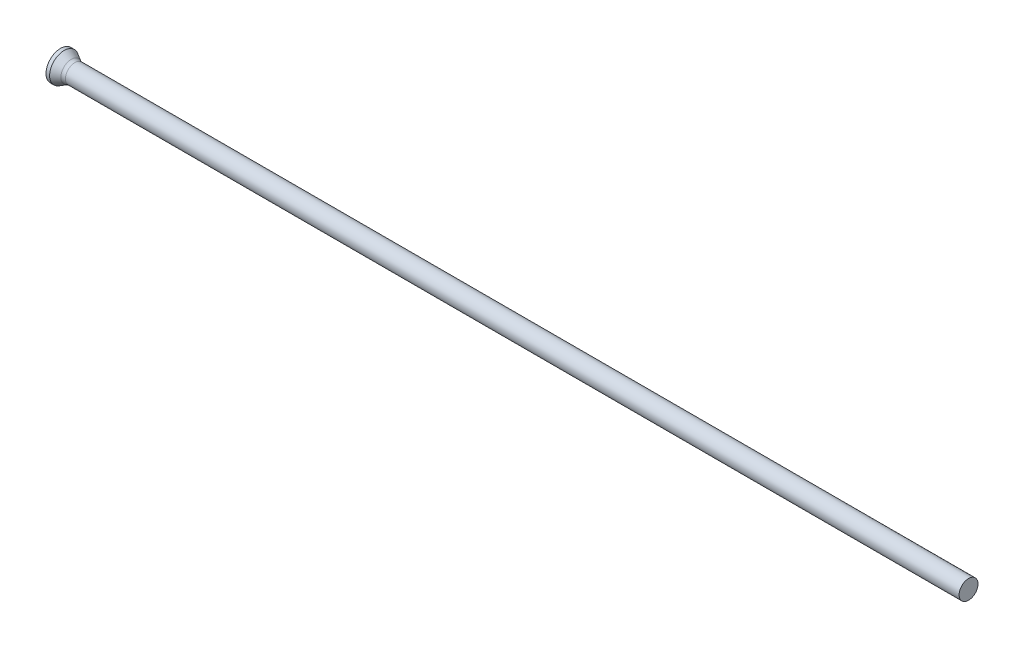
ISO-10303-21;
HEADER;
FILE_DESCRIPTION(('STEP AP214'),'2;1');
FILE_NAME('part.step','',(''),(''),'','','');
FILE_SCHEMA(('AUTOMOTIVE_DESIGN { 1 0 10303 214 1 1 1 1 }'));
ENDSEC;
DATA;
#1=APPLICATION_CONTEXT('core data for automotive mechanical design processes');
#2=APPLICATION_PROTOCOL_DEFINITION('international standard','automotive_design',2000,#1);
#3=PRODUCT_CONTEXT('',#1,'mechanical');
#4=PRODUCT('Part','Part','',(#3));
#5=PRODUCT_RELATED_PRODUCT_CATEGORY('part','',(#4));
#6=PRODUCT_DEFINITION_FORMATION('','',#4);
#7=PRODUCT_DEFINITION_CONTEXT('part definition',#1,'design');
#8=PRODUCT_DEFINITION('design','',#6,#7);
#9=PRODUCT_DEFINITION_SHAPE('','',#8);
#10=(LENGTH_UNIT() NAMED_UNIT(*) SI_UNIT(.MILLI.,.METRE.));
#11=(NAMED_UNIT(*) PLANE_ANGLE_UNIT() SI_UNIT($,.RADIAN.));
#12=(NAMED_UNIT(*) SI_UNIT($,.STERADIAN.) SOLID_ANGLE_UNIT());
#13=UNCERTAINTY_MEASURE_WITH_UNIT(LENGTH_MEASURE(1.E-05),#10,'distance_accuracy_value','');
#14=(GEOMETRIC_REPRESENTATION_CONTEXT(3) GLOBAL_UNCERTAINTY_ASSIGNED_CONTEXT((#13)) GLOBAL_UNIT_ASSIGNED_CONTEXT((#10,
#11,#12)) REPRESENTATION_CONTEXT('',''));
#15=CARTESIAN_POINT('',(0.,0.,0.));
#16=DIRECTION('',(0.,0.,1.));
#17=DIRECTION('',(1.,0.,0.));
#18=AXIS2_PLACEMENT_3D('',#15,#16,#17);
#19=CARTESIAN_POINT('',(0.,0.,0.));
#20=DIRECTION('',(1.,0.,0.));
#21=DIRECTION('',(0.,0.,-1.));
#22=AXIS2_PLACEMENT_3D('',#19,#20,#21);
#23=PLANE('',#22);
#24=CARTESIAN_POINT('',(0.,0.,0.));
#25=DIRECTION('',(-1.,0.,0.));
#26=DIRECTION('',(0.,0.,1.));
#27=AXIS2_PLACEMENT_3D('',#24,#25,#26);
#28=CIRCLE('',#27,2.);
#29=CARTESIAN_POINT('',(0.,0.,2.));
#30=VERTEX_POINT('',#29);
#31=EDGE_CURVE('E25',#30,#30,#28,.T.);
#32=ORIENTED_EDGE('',*,*,#31,.T.);
#33=EDGE_LOOP('',(#32));
#34=FACE_BOUND('',#33,.T.);
#35=ADVANCED_FACE('F14',(#34),#23,.F.);
#36=CARTESIAN_POINT('',(0.,0.,0.));
#37=DIRECTION('',(-1.,0.,0.));
#38=DIRECTION('',(0.,0.,1.));
#39=AXIS2_PLACEMENT_3D('',#36,#37,#38);
#40=CYLINDRICAL_SURFACE('',#39,2.);
#41=ORIENTED_EDGE('',*,*,#31,.F.);
#42=EDGE_LOOP('',(#41));
#43=FACE_BOUND('',#42,.T.);
#44=CARTESIAN_POINT('',(0.497564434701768,0.,0.));
#45=DIRECTION('',(-1.,0.,0.));
#46=DIRECTION('',(0.,0.,1.));
#47=AXIS2_PLACEMENT_3D('',#44,#45,#46);
#48=CIRCLE('',#47,2.);
#49=CARTESIAN_POINT('',(0.497564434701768,0.,2.));
#50=VERTEX_POINT('',#49);
#51=EDGE_CURVE('E29',#50,#50,#48,.T.);
#52=ORIENTED_EDGE('',*,*,#51,.T.);
#53=EDGE_LOOP('',(#52));
#54=FACE_BOUND('',#53,.T.);
#55=ADVANCED_FACE('F53',(#43,#54),#40,.T.);
#56=CARTESIAN_POINT('',(1.71,0.,0.));
#57=DIRECTION('',(-1.,0.,0.));
#58=DIRECTION('',(0.,0.,1.));
#59=AXIS2_PLACEMENT_3D('',#56,#57,#58);
#60=CONICAL_SURFACE('',#59,1.3,0.523598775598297);
#61=CARTESIAN_POINT('',(1.47794919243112,0.,0.));
#62=DIRECTION('',(-1.,0.,0.));
#63=DIRECTION('',(0.,0.,1.));
#64=AXIS2_PLACEMENT_3D('',#61,#62,#63);
#65=CIRCLE('',#64,1.43397459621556);
#66=CARTESIAN_POINT('',(1.47794919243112,0.,1.43397459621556));
#67=VERTEX_POINT('',#66);
#68=EDGE_CURVE('E21',#67,#67,#65,.T.);
#69=ORIENTED_EDGE('',*,*,#68,.T.);
#70=EDGE_LOOP('',(#69));
#71=FACE_BOUND('',#70,.T.);
#72=ORIENTED_EDGE('',*,*,#51,.F.);
#73=EDGE_LOOP('',(#72));
#74=FACE_BOUND('',#73,.T.);
#75=ADVANCED_FACE('F50',(#71,#74),#60,.T.);
#76=CARTESIAN_POINT('',(0.,0.,0.));
#77=DIRECTION('',(-1.,0.,0.));
#78=DIRECTION('',(0.,0.,1.));
#79=AXIS2_PLACEMENT_3D('',#76,#77,#78);
#80=CYLINDRICAL_SURFACE('',#79,1.3);
#81=CARTESIAN_POINT('',(1.97794919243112,0.,0.));
#82=DIRECTION('',(-1.,0.,0.));
#83=DIRECTION('',(0.,0.,1.));
#84=AXIS2_PLACEMENT_3D('',#81,#82,#83);
#85=CIRCLE('',#84,1.3);
#86=CARTESIAN_POINT('',(1.97794919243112,0.,1.3));
#87=VERTEX_POINT('',#86);
#88=EDGE_CURVE('E9',#87,#87,#85,.F.);
#89=ORIENTED_EDGE('',*,*,#88,.T.);
#90=EDGE_LOOP('',(#89));
#91=FACE_BOUND('',#90,.T.);
#92=CARTESIAN_POINT('',(125.,0.,0.));
#93=DIRECTION('',(-1.,0.,0.));
#94=DIRECTION('',(0.,0.,1.));
#95=AXIS2_PLACEMENT_3D('',#92,#93,#94);
#96=CIRCLE('',#95,1.3);
#97=CARTESIAN_POINT('',(125.,0.,1.3));
#98=VERTEX_POINT('',#97);
#99=EDGE_CURVE('E34',#98,#98,#96,.T.);
#100=ORIENTED_EDGE('',*,*,#99,.T.);
#101=EDGE_LOOP('',(#100));
#102=FACE_BOUND('',#101,.T.);
#103=ADVANCED_FACE('F38',(#91,#102),#80,.T.);
#104=CARTESIAN_POINT('',(125.,1.3,0.));
#105=DIRECTION('',(-1.,0.,0.));
#106=DIRECTION('',(0.,0.,1.));
#107=AXIS2_PLACEMENT_3D('',#104,#105,#106);
#108=PLANE('',#107);
#109=ORIENTED_EDGE('',*,*,#99,.F.);
#110=EDGE_LOOP('',(#109));
#111=FACE_BOUND('',#110,.T.);
#112=ADVANCED_FACE('F40',(#111),#108,.F.);
#113=CARTESIAN_POINT('',(1.97794919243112,0.,0.));
#114=DIRECTION('',(-1.,0.,0.));
#115=DIRECTION('',(0.,0.,1.));
#116=AXIS2_PLACEMENT_3D('',#113,#114,#115);
#117=TOROIDAL_SURFACE('',#116,2.3,1.);
#118=ORIENTED_EDGE('',*,*,#88,.F.);
#119=EDGE_LOOP('',(#118));
#120=FACE_BOUND('',#119,.T.);
#121=ORIENTED_EDGE('',*,*,#68,.F.);
#122=EDGE_LOOP('',(#121));
#123=FACE_BOUND('',#122,.T.);
#124=ADVANCED_FACE('F16',(#120,#123),#117,.F.);
#125=CLOSED_SHELL('',(#35,#55,#75,#103,#112,#124));
#126=MANIFOLD_SOLID_BREP('B1',#125);
#127=ADVANCED_BREP_SHAPE_REPRESENTATION('',(#18,#126),#14);
#128=SHAPE_DEFINITION_REPRESENTATION(#9,#127);
ENDSEC;
END-ISO-10303-21;
